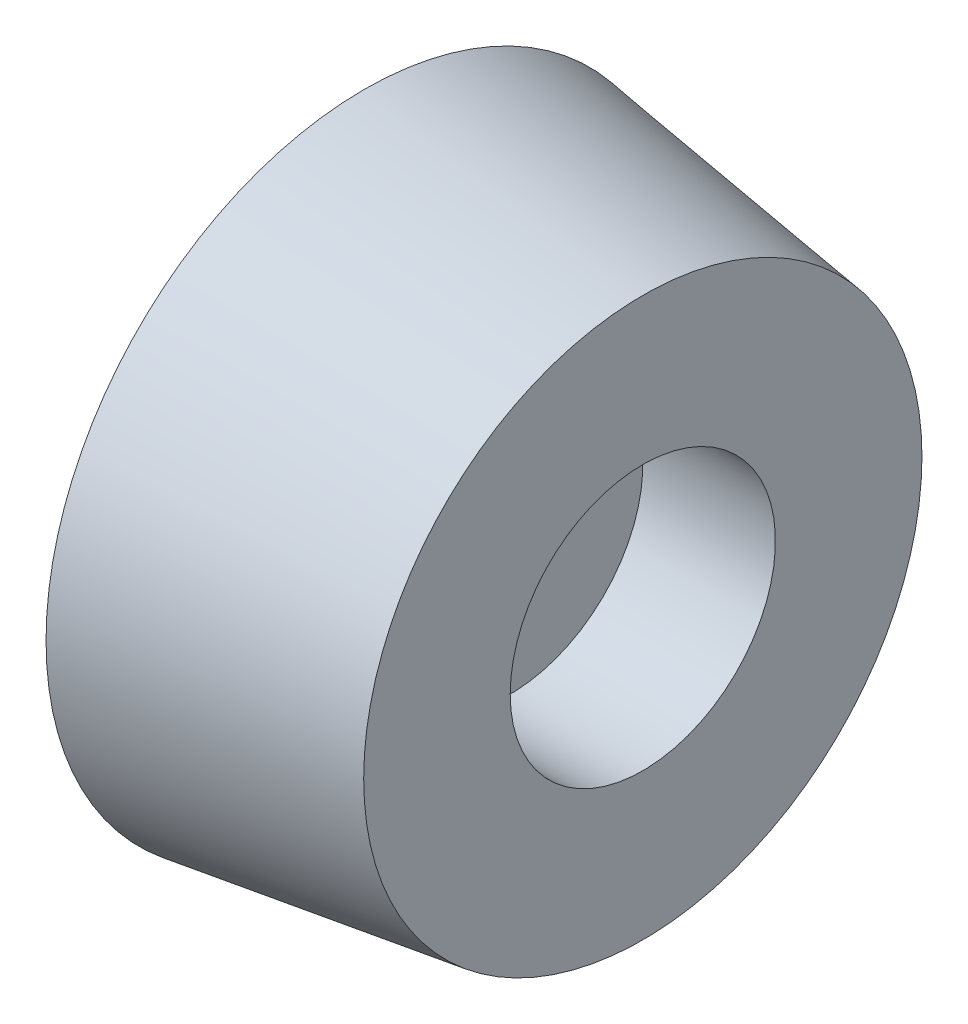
from build123d import *


with BuildPart() as part:
    # Skica1 → Rotovat1 (revolve)
    with BuildSketch(Plane.XY, mode=Mode.PRIVATE) as rotovat1_sk:
        Polygon((-1, 10.485258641), (-1, 1.5), (4.5, 1.5), (4.5, 5), (9.5, 5), (9.5, 10.524321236), (-1, 12), align=None)
    revolve(rotovat1_sk.sketch.rotate(Axis((0, 0, 0), (1, 0, 0)), 90), axis=Axis((0, 0, 0), (1, 0, 0)))


solid = part.part
